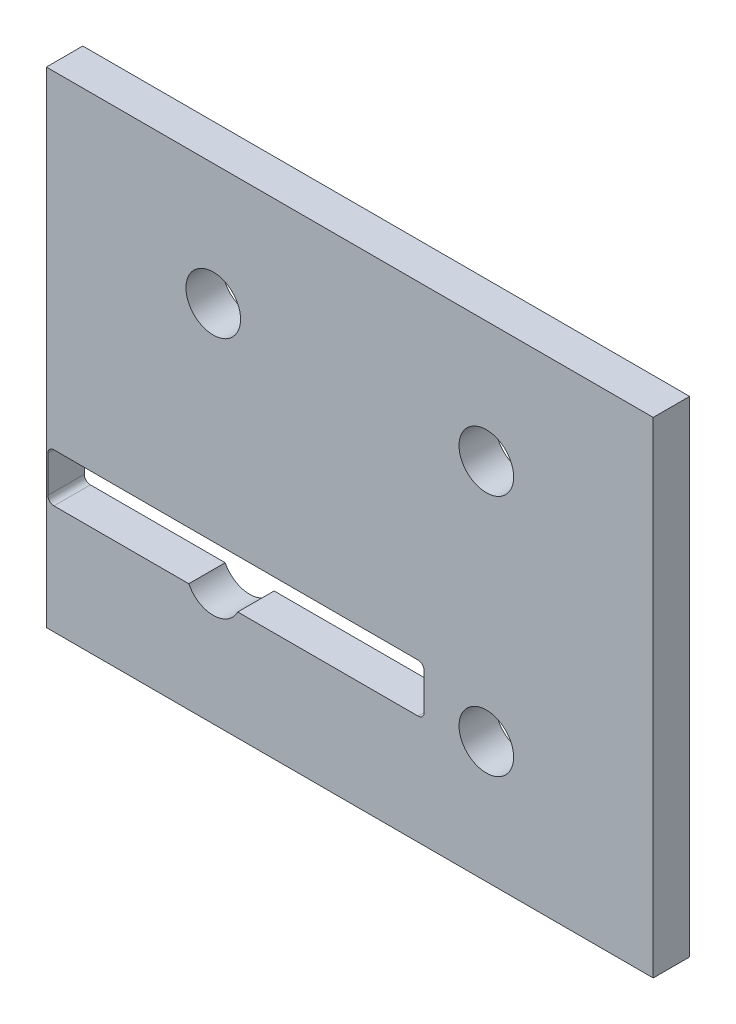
ISO-10303-21;
HEADER;
FILE_DESCRIPTION(('STEP AP214'),'2;1');
FILE_NAME('part.step','',(''),(''),'','','');
FILE_SCHEMA(('AUTOMOTIVE_DESIGN { 1 0 10303 214 1 1 1 1 }'));
ENDSEC;
DATA;
#1=APPLICATION_CONTEXT('core data for automotive mechanical design processes');
#2=APPLICATION_PROTOCOL_DEFINITION('international standard','automotive_design',2000,#1);
#3=PRODUCT_CONTEXT('',#1,'mechanical');
#4=PRODUCT('Part','Part','',(#3));
#5=PRODUCT_RELATED_PRODUCT_CATEGORY('part','',(#4));
#6=PRODUCT_DEFINITION_FORMATION('','',#4);
#7=PRODUCT_DEFINITION_CONTEXT('part definition',#1,'design');
#8=PRODUCT_DEFINITION('design','',#6,#7);
#9=PRODUCT_DEFINITION_SHAPE('','',#8);
#10=(LENGTH_UNIT() NAMED_UNIT(*) SI_UNIT(.MILLI.,.METRE.));
#11=(NAMED_UNIT(*) PLANE_ANGLE_UNIT() SI_UNIT($,.RADIAN.));
#12=(NAMED_UNIT(*) SI_UNIT($,.STERADIAN.) SOLID_ANGLE_UNIT());
#13=UNCERTAINTY_MEASURE_WITH_UNIT(LENGTH_MEASURE(1.E-05),#10,'distance_accuracy_value','');
#14=(GEOMETRIC_REPRESENTATION_CONTEXT(3) GLOBAL_UNCERTAINTY_ASSIGNED_CONTEXT((#13)) GLOBAL_UNIT_ASSIGNED_CONTEXT((#10,
#11,#12)) REPRESENTATION_CONTEXT('',''));
#15=CARTESIAN_POINT('',(0.,0.,0.));
#16=DIRECTION('',(0.,0.,1.));
#17=DIRECTION('',(1.,0.,0.));
#18=AXIS2_PLACEMENT_3D('',#15,#16,#17);
#19=CARTESIAN_POINT('',(45.,40.,0.));
#20=DIRECTION('',(0.,0.,-1.));
#21=DIRECTION('',(1.,0.,0.));
#22=AXIS2_PLACEMENT_3D('',#19,#20,#21);
#23=CYLINDRICAL_SURFACE('',#22,9.);
#24=DIRECTION('',(0.,0.,1.));
#25=VECTOR('',#24,1.);
#26=CARTESIAN_POINT('',(54.,40.,0.));
#27=LINE('',#26,#25);
#28=CARTESIAN_POINT('',(54.,40.,0.));
#29=VERTEX_POINT('',#28);
#30=CARTESIAN_POINT('',(54.,40.,12.));
#31=VERTEX_POINT('',#30);
#32=EDGE_CURVE('E10',#29,#31,#27,.T.);
#33=ORIENTED_EDGE('',*,*,#32,.T.);
#34=CARTESIAN_POINT('',(45.,40.,12.));
#35=DIRECTION('',(0.,0.,1.));
#36=DIRECTION('',(1.,0.,0.));
#37=AXIS2_PLACEMENT_3D('',#34,#35,#36);
#38=CIRCLE('',#37,9.);
#39=EDGE_CURVE('E290',#31,#31,#38,.T.);
#40=ORIENTED_EDGE('',*,*,#39,.T.);
#41=ORIENTED_EDGE('',*,*,#32,.F.);
#42=CARTESIAN_POINT('',(45.,40.,0.));
#43=DIRECTION('',(0.,0.,1.));
#44=DIRECTION('',(1.,0.,0.));
#45=AXIS2_PLACEMENT_3D('',#42,#43,#44);
#46=CIRCLE('',#45,9.);
#47=EDGE_CURVE('E240',#29,#29,#46,.T.);
#48=ORIENTED_EDGE('',*,*,#47,.F.);
#49=EDGE_LOOP('',(#33,#40,#41,#48));
#50=FACE_BOUND('',#49,.T.);
#51=ADVANCED_FACE('F16',(#50),#23,.F.);
#52=CARTESIAN_POINT('',(-45.,40.,0.));
#53=DIRECTION('',(0.,0.,-1.));
#54=DIRECTION('',(1.,0.,0.));
#55=AXIS2_PLACEMENT_3D('',#52,#53,#54);
#56=CYLINDRICAL_SURFACE('',#55,9.);
#57=DIRECTION('',(0.,0.,1.));
#58=VECTOR('',#57,1.);
#59=CARTESIAN_POINT('',(-36.,40.,0.));
#60=LINE('',#59,#58);
#61=CARTESIAN_POINT('',(-36.,40.,0.));
#62=VERTEX_POINT('',#61);
#63=CARTESIAN_POINT('',(-36.,40.,12.));
#64=VERTEX_POINT('',#63);
#65=EDGE_CURVE('E19',#62,#64,#60,.T.);
#66=ORIENTED_EDGE('',*,*,#65,.T.);
#67=CARTESIAN_POINT('',(-45.,40.,12.));
#68=DIRECTION('',(0.,0.,1.));
#69=DIRECTION('',(1.,0.,0.));
#70=AXIS2_PLACEMENT_3D('',#67,#68,#69);
#71=CIRCLE('',#70,9.);
#72=EDGE_CURVE('E287',#64,#64,#71,.T.);
#73=ORIENTED_EDGE('',*,*,#72,.T.);
#74=ORIENTED_EDGE('',*,*,#65,.F.);
#75=CARTESIAN_POINT('',(-45.,40.,0.));
#76=DIRECTION('',(0.,0.,1.));
#77=DIRECTION('',(1.,0.,0.));
#78=AXIS2_PLACEMENT_3D('',#75,#76,#77);
#79=CIRCLE('',#78,9.);
#80=EDGE_CURVE('E236',#62,#62,#79,.T.);
#81=ORIENTED_EDGE('',*,*,#80,.F.);
#82=EDGE_LOOP('',(#66,#73,#74,#81));
#83=FACE_BOUND('',#82,.T.);
#84=ADVANCED_FACE('F462',(#83),#56,.F.);
#85=CARTESIAN_POINT('',(45.,-40.,0.));
#86=DIRECTION('',(0.,0.,-1.));
#87=DIRECTION('',(1.,0.,0.));
#88=AXIS2_PLACEMENT_3D('',#85,#86,#87);
#89=CYLINDRICAL_SURFACE('',#88,9.);
#90=DIRECTION('',(0.,0.,1.));
#91=VECTOR('',#90,1.);
#92=CARTESIAN_POINT('',(54.,-40.,0.));
#93=LINE('',#92,#91);
#94=CARTESIAN_POINT('',(54.,-40.,0.));
#95=VERTEX_POINT('',#94);
#96=CARTESIAN_POINT('',(54.,-40.,12.));
#97=VERTEX_POINT('',#96);
#98=EDGE_CURVE('E307',#95,#97,#93,.T.);
#99=ORIENTED_EDGE('',*,*,#98,.T.);
#100=CARTESIAN_POINT('',(45.,-40.,12.));
#101=DIRECTION('',(0.,0.,1.));
#102=DIRECTION('',(1.,0.,0.));
#103=AXIS2_PLACEMENT_3D('',#100,#101,#102);
#104=CIRCLE('',#103,9.);
#105=EDGE_CURVE('E215',#97,#97,#104,.T.);
#106=ORIENTED_EDGE('',*,*,#105,.T.);
#107=ORIENTED_EDGE('',*,*,#98,.F.);
#108=CARTESIAN_POINT('',(45.,-40.,0.));
#109=DIRECTION('',(0.,0.,1.));
#110=DIRECTION('',(1.,0.,0.));
#111=AXIS2_PLACEMENT_3D('',#108,#109,#110);
#112=CIRCLE('',#111,9.);
#113=EDGE_CURVE('E232',#95,#95,#112,.T.);
#114=ORIENTED_EDGE('',*,*,#113,.F.);
#115=EDGE_LOOP('',(#99,#106,#107,#114));
#116=FACE_BOUND('',#115,.T.);
#117=ADVANCED_FACE('F446',(#116),#89,.F.);
#118=CARTESIAN_POINT('',(-37.5,-44.,54.));
#119=DIRECTION('',(0.,1.,0.));
#120=DIRECTION('',(1.,0.,0.));
#121=AXIS2_PLACEMENT_3D('',#118,#119,#120);
#122=PLANE('',#121);
#123=DIRECTION('',(-1.,0.,0.));
#124=VECTOR('',#123,1.);
#125=CARTESIAN_POINT('',(-18.75,-44.,0.));
#126=LINE('',#125,#124);
#127=CARTESIAN_POINT('',(-53.06225774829,-44.,0.));
#128=VERTEX_POINT('',#127);
#129=CARTESIAN_POINT('',(-97.5,-44.,0.));
#130=VERTEX_POINT('',#129);
#131=EDGE_CURVE('E224',#128,#130,#126,.T.);
#132=ORIENTED_EDGE('',*,*,#131,.T.);
#133=DIRECTION('',(0.,0.,1.));
#134=VECTOR('',#133,1.);
#135=CARTESIAN_POINT('',(-97.5,-44.,-6.));
#136=LINE('',#135,#134);
#137=CARTESIAN_POINT('',(-97.5,-44.,12.));
#138=VERTEX_POINT('',#137);
#139=EDGE_CURVE('E248',#130,#138,#136,.T.);
#140=ORIENTED_EDGE('',*,*,#139,.T.);
#141=DIRECTION('',(-1.,0.,0.));
#142=VECTOR('',#141,1.);
#143=CARTESIAN_POINT('',(-18.75,-44.,12.));
#144=LINE('',#143,#142);
#145=CARTESIAN_POINT('',(-53.06225774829,-44.,12.));
#146=VERTEX_POINT('',#145);
#147=EDGE_CURVE('E256',#146,#138,#144,.T.);
#148=ORIENTED_EDGE('',*,*,#147,.F.);
#149=DIRECTION('',(0.,0.,-1.));
#150=VECTOR('',#149,1.);
#151=CARTESIAN_POINT('',(-53.06225774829,-44.,0.));
#152=LINE('',#151,#150);
#153=EDGE_CURVE('E293',#146,#128,#152,.T.);
#154=ORIENTED_EDGE('',*,*,#153,.T.);
#155=EDGE_LOOP('',(#132,#140,#148,#154));
#156=FACE_BOUND('',#155,.T.);
#157=ADVANCED_FACE('F441',(#156),#122,.T.);
#158=CARTESIAN_POINT('',(-97.5,-42.,-6.));
#159=DIRECTION('',(0.,0.,1.));
#160=DIRECTION('',(0.,1.,0.));
#161=AXIS2_PLACEMENT_3D('',#158,#159,#160);
#162=CYLINDRICAL_SURFACE('',#161,2.);
#163=CARTESIAN_POINT('',(-97.5,-42.,12.));
#164=DIRECTION('',(0.,0.,1.));
#165=DIRECTION('',(0.,1.,0.));
#166=AXIS2_PLACEMENT_3D('',#163,#164,#165);
#167=CIRCLE('',#166,2.);
#168=CARTESIAN_POINT('',(-99.5,-42.,12.));
#169=VERTEX_POINT('',#168);
#170=EDGE_CURVE('E257',#169,#138,#167,.T.);
#171=ORIENTED_EDGE('',*,*,#170,.T.);
#172=ORIENTED_EDGE('',*,*,#139,.F.);
#173=CARTESIAN_POINT('',(-97.5,-42.,0.));
#174=DIRECTION('',(0.,0.,1.));
#175=DIRECTION('',(0.,1.,0.));
#176=AXIS2_PLACEMENT_3D('',#173,#174,#175);
#177=CIRCLE('',#176,2.);
#178=CARTESIAN_POINT('',(-99.5,-42.,0.));
#179=VERTEX_POINT('',#178);
#180=EDGE_CURVE('E220',#179,#130,#177,.T.);
#181=ORIENTED_EDGE('',*,*,#180,.F.);
#182=DIRECTION('',(0.,0.,1.));
#183=VECTOR('',#182,1.);
#184=CARTESIAN_POINT('',(-99.5,-42.,-6.));
#185=LINE('',#184,#183);
#186=EDGE_CURVE('E245',#179,#169,#185,.T.);
#187=ORIENTED_EDGE('',*,*,#186,.T.);
#188=EDGE_LOOP('',(#171,#172,#181,#187));
#189=FACE_BOUND('',#188,.T.);
#190=ADVANCED_FACE('F435',(#189),#162,.F.);
#191=CARTESIAN_POINT('',(-99.5,-42.,-6.));
#192=DIRECTION('',(1.,0.,0.));
#193=DIRECTION('',(0.,1.,0.));
#194=AXIS2_PLACEMENT_3D('',#191,#192,#193);
#195=PLANE('',#194);
#196=ORIENTED_EDGE('',*,*,#186,.F.);
#197=DIRECTION('',(0.,1.,0.));
#198=VECTOR('',#197,1.);
#199=CARTESIAN_POINT('',(-99.5,-21.,0.));
#200=LINE('',#199,#198);
#201=CARTESIAN_POINT('',(-99.5,-30.,0.));
#202=VERTEX_POINT('',#201);
#203=EDGE_CURVE('E219',#179,#202,#200,.T.);
#204=ORIENTED_EDGE('',*,*,#203,.T.);
#205=DIRECTION('',(0.,0.,1.));
#206=VECTOR('',#205,1.);
#207=CARTESIAN_POINT('',(-99.5,-30.,-6.));
#208=LINE('',#207,#206);
#209=CARTESIAN_POINT('',(-99.5,-30.,12.));
#210=VERTEX_POINT('',#209);
#211=EDGE_CURVE('E249',#202,#210,#208,.T.);
#212=ORIENTED_EDGE('',*,*,#211,.T.);
#213=DIRECTION('',(0.,1.,0.));
#214=VECTOR('',#213,1.);
#215=CARTESIAN_POINT('',(-99.5,-21.,12.));
#216=LINE('',#215,#214);
#217=EDGE_CURVE('E261',#169,#210,#216,.T.);
#218=ORIENTED_EDGE('',*,*,#217,.F.);
#219=EDGE_LOOP('',(#196,#204,#212,#218));
#220=FACE_BOUND('',#219,.T.);
#221=ADVANCED_FACE('F381',(#220),#195,.T.);
#222=CARTESIAN_POINT('',(-97.5,-30.,-6.));
#223=DIRECTION('',(0.,0.,1.));
#224=DIRECTION('',(0.,-1.,0.));
#225=AXIS2_PLACEMENT_3D('',#222,#223,#224);
#226=CYLINDRICAL_SURFACE('',#225,2.);
#227=ORIENTED_EDGE('',*,*,#211,.F.);
#228=CARTESIAN_POINT('',(-97.5,-30.,0.));
#229=DIRECTION('',(0.,0.,1.));
#230=DIRECTION('',(0.,-1.,0.));
#231=AXIS2_PLACEMENT_3D('',#228,#229,#230);
#232=CIRCLE('',#231,2.);
#233=CARTESIAN_POINT('',(-97.5,-28.,0.));
#234=VERTEX_POINT('',#233);
#235=EDGE_CURVE('E195',#234,#202,#232,.T.);
#236=ORIENTED_EDGE('',*,*,#235,.F.);
#237=DIRECTION('',(0.,0.,1.));
#238=VECTOR('',#237,1.);
#239=CARTESIAN_POINT('',(-97.5,-28.,-6.));
#240=LINE('',#239,#238);
#241=CARTESIAN_POINT('',(-97.5,-28.,12.));
#242=VERTEX_POINT('',#241);
#243=EDGE_CURVE('E185',#234,#242,#240,.T.);
#244=ORIENTED_EDGE('',*,*,#243,.T.);
#245=CARTESIAN_POINT('',(-97.5,-30.,12.));
#246=DIRECTION('',(0.,0.,1.));
#247=DIRECTION('',(0.,-1.,0.));
#248=AXIS2_PLACEMENT_3D('',#245,#246,#247);
#249=CIRCLE('',#248,2.);
#250=EDGE_CURVE('E265',#242,#210,#249,.T.);
#251=ORIENTED_EDGE('',*,*,#250,.T.);
#252=EDGE_LOOP('',(#227,#236,#244,#251));
#253=FACE_BOUND('',#252,.T.);
#254=ADVANCED_FACE('F333',(#253),#226,.F.);
#255=CARTESIAN_POINT('',(-37.5,-28.,54.));
#256=DIRECTION('',(0.,1.,0.));
#257=DIRECTION('',(1.,0.,0.));
#258=AXIS2_PLACEMENT_3D('',#255,#256,#257);
#259=PLANE('',#258);
#260=DIRECTION('',(0.,0.,-1.));
#261=VECTOR('',#260,1.);
#262=CARTESIAN_POINT('',(22.5,-28.,114.));
#263=LINE('',#262,#261);
#264=CARTESIAN_POINT('',(22.5,-28.,12.));
#265=VERTEX_POINT('',#264);
#266=CARTESIAN_POINT('',(22.5,-28.,0.));
#267=VERTEX_POINT('',#266);
#268=EDGE_CURVE('E173',#265,#267,#263,.T.);
#269=ORIENTED_EDGE('',*,*,#268,.F.);
#270=DIRECTION('',(-1.,0.,0.));
#271=VECTOR('',#270,1.);
#272=CARTESIAN_POINT('',(-18.75,-28.,12.));
#273=LINE('',#272,#271);
#274=EDGE_CURVE('E269',#265,#242,#273,.T.);
#275=ORIENTED_EDGE('',*,*,#274,.T.);
#276=ORIENTED_EDGE('',*,*,#243,.F.);
#277=DIRECTION('',(-1.,0.,0.));
#278=VECTOR('',#277,1.);
#279=CARTESIAN_POINT('',(-18.75,-28.,0.));
#280=LINE('',#279,#278);
#281=EDGE_CURVE('E189',#267,#234,#280,.T.);
#282=ORIENTED_EDGE('',*,*,#281,.F.);
#283=EDGE_LOOP('',(#269,#275,#276,#282));
#284=FACE_BOUND('',#283,.T.);
#285=ADVANCED_FACE('F190',(#284),#259,.F.);
#286=CARTESIAN_POINT('',(22.5,-30.,114.));
#287=DIRECTION('',(0.,0.,-1.));
#288=DIRECTION('',(0.,-1.,0.));
#289=AXIS2_PLACEMENT_3D('',#286,#287,#288);
#290=CYLINDRICAL_SURFACE('',#289,2.);
#291=DIRECTION('',(0.,0.,-1.));
#292=VECTOR('',#291,1.);
#293=CARTESIAN_POINT('',(24.5,-30.,114.));
#294=LINE('',#293,#292);
#295=CARTESIAN_POINT('',(24.5,-30.,12.));
#296=VERTEX_POINT('',#295);
#297=CARTESIAN_POINT('',(24.5,-30.,0.));
#298=VERTEX_POINT('',#297);
#299=EDGE_CURVE('E186',#296,#298,#294,.T.);
#300=ORIENTED_EDGE('',*,*,#299,.F.);
#301=CARTESIAN_POINT('',(22.5,-30.,12.));
#302=DIRECTION('',(0.,0.,-1.));
#303=DIRECTION('',(0.,-1.,0.));
#304=AXIS2_PLACEMENT_3D('',#301,#302,#303);
#305=CIRCLE('',#304,2.);
#306=EDGE_CURVE('E180',#265,#296,#305,.T.);
#307=ORIENTED_EDGE('',*,*,#306,.F.);
#308=ORIENTED_EDGE('',*,*,#268,.T.);
#309=CARTESIAN_POINT('',(22.5,-30.,0.));
#310=DIRECTION('',(0.,0.,-1.));
#311=DIRECTION('',(0.,-1.,0.));
#312=AXIS2_PLACEMENT_3D('',#309,#310,#311);
#313=CIRCLE('',#312,2.);
#314=EDGE_CURVE('E177',#267,#298,#313,.T.);
#315=ORIENTED_EDGE('',*,*,#314,.T.);
#316=EDGE_LOOP('',(#300,#307,#308,#315));
#317=FACE_BOUND('',#316,.T.);
#318=ADVANCED_FACE('F175',(#317),#290,.F.);
#319=CARTESIAN_POINT('',(24.5,-42.,114.));
#320=DIRECTION('',(-1.,0.,0.));
#321=DIRECTION('',(0.,0.,1.));
#322=AXIS2_PLACEMENT_3D('',#319,#320,#321);
#323=PLANE('',#322);
#324=DIRECTION('',(0.,0.,-1.));
#325=VECTOR('',#324,1.);
#326=CARTESIAN_POINT('',(24.5,-42.,114.));
#327=LINE('',#326,#325);
#328=CARTESIAN_POINT('',(24.5,-42.,12.));
#329=VERTEX_POINT('',#328);
#330=CARTESIAN_POINT('',(24.5,-42.,0.));
#331=VERTEX_POINT('',#330);
#332=EDGE_CURVE('E274',#329,#331,#327,.T.);
#333=ORIENTED_EDGE('',*,*,#332,.F.);
#334=DIRECTION('',(0.,-1.,0.));
#335=VECTOR('',#334,1.);
#336=CARTESIAN_POINT('',(24.5,-21.,12.));
#337=LINE('',#336,#335);
#338=EDGE_CURVE('E277',#296,#329,#337,.T.);
#339=ORIENTED_EDGE('',*,*,#338,.F.);
#340=ORIENTED_EDGE('',*,*,#299,.T.);
#341=DIRECTION('',(0.,-1.,0.));
#342=VECTOR('',#341,1.);
#343=CARTESIAN_POINT('',(24.5,-21.,0.));
#344=LINE('',#343,#342);
#345=EDGE_CURVE('E202',#298,#331,#344,.T.);
#346=ORIENTED_EDGE('',*,*,#345,.T.);
#347=EDGE_LOOP('',(#333,#339,#340,#346));
#348=FACE_BOUND('',#347,.T.);
#349=ADVANCED_FACE('F339',(#348),#323,.T.);
#350=CARTESIAN_POINT('',(22.5,-42.,114.));
#351=DIRECTION('',(0.,0.,-1.));
#352=DIRECTION('',(0.,1.,0.));
#353=AXIS2_PLACEMENT_3D('',#350,#351,#352);
#354=CYLINDRICAL_SURFACE('',#353,2.);
#355=CARTESIAN_POINT('',(22.5,-42.,0.));
#356=DIRECTION('',(0.,0.,-1.));
#357=DIRECTION('',(0.,1.,0.));
#358=AXIS2_PLACEMENT_3D('',#355,#356,#357);
#359=CIRCLE('',#358,2.);
#360=CARTESIAN_POINT('',(22.5,-44.,0.));
#361=VERTEX_POINT('',#360);
#362=EDGE_CURVE('E208',#331,#361,#359,.T.);
#363=ORIENTED_EDGE('',*,*,#362,.T.);
#364=DIRECTION('',(0.,0.,-1.));
#365=VECTOR('',#364,1.);
#366=CARTESIAN_POINT('',(22.5,-44.,114.));
#367=LINE('',#366,#365);
#368=CARTESIAN_POINT('',(22.5,-44.,12.));
#369=VERTEX_POINT('',#368);
#370=EDGE_CURVE('E297',#369,#361,#367,.T.);
#371=ORIENTED_EDGE('',*,*,#370,.F.);
#372=CARTESIAN_POINT('',(22.5,-42.,12.));
#373=DIRECTION('',(0.,0.,-1.));
#374=DIRECTION('',(0.,1.,0.));
#375=AXIS2_PLACEMENT_3D('',#372,#373,#374);
#376=CIRCLE('',#375,2.);
#377=EDGE_CURVE('E216',#329,#369,#376,.T.);
#378=ORIENTED_EDGE('',*,*,#377,.F.);
#379=ORIENTED_EDGE('',*,*,#332,.T.);
#380=EDGE_LOOP('',(#363,#371,#378,#379));
#381=FACE_BOUND('',#380,.T.);
#382=ADVANCED_FACE('F344',(#381),#354,.F.);
#383=CARTESIAN_POINT('',(-37.5,-44.,54.));
#384=DIRECTION('',(0.,1.,0.));
#385=DIRECTION('',(1.,0.,0.));
#386=AXIS2_PLACEMENT_3D('',#383,#384,#385);
#387=PLANE('',#386);
#388=ORIENTED_EDGE('',*,*,#370,.T.);
#389=DIRECTION('',(-1.,0.,0.));
#390=VECTOR('',#389,1.);
#391=CARTESIAN_POINT('',(-18.75,-44.,0.));
#392=LINE('',#391,#390);
#393=CARTESIAN_POINT('',(-36.9377422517,-44.,0.));
#394=VERTEX_POINT('',#393);
#395=EDGE_CURVE('E528',#361,#394,#392,.T.);
#396=ORIENTED_EDGE('',*,*,#395,.T.);
#397=DIRECTION('',(0.,0.,-1.));
#398=VECTOR('',#397,1.);
#399=CARTESIAN_POINT('',(-36.9377422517,-44.,0.));
#400=LINE('',#399,#398);
#401=CARTESIAN_POINT('',(-36.9377422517,-44.,12.));
#402=VERTEX_POINT('',#401);
#403=EDGE_CURVE('E294',#402,#394,#400,.T.);
#404=ORIENTED_EDGE('',*,*,#403,.F.);
#405=DIRECTION('',(-1.,0.,0.));
#406=VECTOR('',#405,1.);
#407=CARTESIAN_POINT('',(-18.75,-44.,12.));
#408=LINE('',#407,#406);
#409=EDGE_CURVE('E212',#369,#402,#408,.T.);
#410=ORIENTED_EDGE('',*,*,#409,.F.);
#411=EDGE_LOOP('',(#388,#396,#404,#410));
#412=FACE_BOUND('',#411,.T.);
#413=ADVANCED_FACE('F360',(#412),#387,.T.);
#414=CARTESIAN_POINT('',(-45.,-40.,0.));
#415=DIRECTION('',(0.,0.,-1.));
#416=DIRECTION('',(1.,0.,0.));
#417=AXIS2_PLACEMENT_3D('',#414,#415,#416);
#418=CYLINDRICAL_SURFACE('',#417,9.);
#419=CARTESIAN_POINT('',(-45.,-40.,0.));
#420=DIRECTION('',(0.,0.,1.));
#421=DIRECTION('',(1.,0.,0.));
#422=AXIS2_PLACEMENT_3D('',#419,#420,#421);
#423=CIRCLE('',#422,9.);
#424=EDGE_CURVE('E228',#128,#394,#423,.T.);
#425=ORIENTED_EDGE('',*,*,#424,.F.);
#426=ORIENTED_EDGE('',*,*,#153,.F.);
#427=CARTESIAN_POINT('',(-45.,-40.,12.));
#428=DIRECTION('',(0.,0.,1.));
#429=DIRECTION('',(1.,0.,0.));
#430=AXIS2_PLACEMENT_3D('',#427,#428,#429);
#431=CIRCLE('',#430,9.);
#432=EDGE_CURVE('E252',#146,#402,#431,.T.);
#433=ORIENTED_EDGE('',*,*,#432,.T.);
#434=ORIENTED_EDGE('',*,*,#403,.T.);
#435=EDGE_LOOP('',(#425,#426,#433,#434));
#436=FACE_BOUND('',#435,.T.);
#437=ADVANCED_FACE('F365',(#436),#418,.F.);
#438=CARTESIAN_POINT('',(100.,80.,0.));
#439=DIRECTION('',(0.,-1.,0.));
#440=DIRECTION('',(0.,0.,-1.));
#441=AXIS2_PLACEMENT_3D('',#438,#439,#440);
#442=PLANE('',#441);
#443=DIRECTION('',(-1.,0.,0.));
#444=VECTOR('',#443,1.);
#445=CARTESIAN_POINT('',(100.,80.,0.));
#446=LINE('',#445,#444);
#447=CARTESIAN_POINT('',(100.,80.,0.));
#448=VERTEX_POINT('',#447);
#449=CARTESIAN_POINT('',(-100.,80.,0.));
#450=VERTEX_POINT('',#449);
#451=EDGE_CURVE('E519',#448,#450,#446,.T.);
#452=ORIENTED_EDGE('',*,*,#451,.T.);
#453=DIRECTION('',(0.,0.,1.));
#454=VECTOR('',#453,1.);
#455=CARTESIAN_POINT('',(-100.,80.,0.));
#456=LINE('',#455,#454);
#457=CARTESIAN_POINT('',(-100.,80.,12.));
#458=VERTEX_POINT('',#457);
#459=EDGE_CURVE('E524',#450,#458,#456,.T.);
#460=ORIENTED_EDGE('',*,*,#459,.T.);
#461=DIRECTION('',(-1.,0.,0.));
#462=VECTOR('',#461,1.);
#463=CARTESIAN_POINT('',(100.,80.,12.));
#464=LINE('',#463,#462);
#465=CARTESIAN_POINT('',(100.,80.,12.));
#466=VERTEX_POINT('',#465);
#467=EDGE_CURVE('E244',#466,#458,#464,.T.);
#468=ORIENTED_EDGE('',*,*,#467,.F.);
#469=DIRECTION('',(0.,0.,1.));
#470=VECTOR('',#469,1.);
#471=CARTESIAN_POINT('',(100.,80.,0.));
#472=LINE('',#471,#470);
#473=EDGE_CURVE('E520',#448,#466,#472,.T.);
#474=ORIENTED_EDGE('',*,*,#473,.F.);
#475=EDGE_LOOP('',(#452,#460,#468,#474));
#476=FACE_BOUND('',#475,.T.);
#477=ADVANCED_FACE('F390',(#476),#442,.F.);
#478=CARTESIAN_POINT('',(0.,0.,12.));
#479=DIRECTION('',(0.,0.,1.));
#480=DIRECTION('',(1.,0.,0.));
#481=AXIS2_PLACEMENT_3D('',#478,#479,#480);
#482=PLANE('',#481);
#483=ORIENTED_EDGE('',*,*,#39,.F.);
#484=EDGE_LOOP('',(#483));
#485=FACE_BOUND('',#484,.T.);
#486=ORIENTED_EDGE('',*,*,#72,.F.);
#487=EDGE_LOOP('',(#486));
#488=FACE_BOUND('',#487,.T.);
#489=ORIENTED_EDGE('',*,*,#105,.F.);
#490=EDGE_LOOP('',(#489));
#491=FACE_BOUND('',#490,.T.);
#492=ORIENTED_EDGE('',*,*,#432,.F.);
#493=ORIENTED_EDGE('',*,*,#147,.T.);
#494=ORIENTED_EDGE('',*,*,#170,.F.);
#495=ORIENTED_EDGE('',*,*,#217,.T.);
#496=ORIENTED_EDGE('',*,*,#250,.F.);
#497=ORIENTED_EDGE('',*,*,#274,.F.);
#498=ORIENTED_EDGE('',*,*,#306,.T.);
#499=ORIENTED_EDGE('',*,*,#338,.T.);
#500=ORIENTED_EDGE('',*,*,#377,.T.);
#501=ORIENTED_EDGE('',*,*,#409,.T.);
#502=EDGE_LOOP('',(#492,#493,#494,#495,#496,#497,#498,#499,#500,#501));
#503=FACE_BOUND('',#502,.T.);
#504=DIRECTION('',(1.,0.,0.));
#505=VECTOR('',#504,1.);
#506=CARTESIAN_POINT('',(-100.,-80.,12.));
#507=LINE('',#506,#505);
#508=CARTESIAN_POINT('',(-100.,-80.,12.));
#509=VERTEX_POINT('',#508);
#510=CARTESIAN_POINT('',(100.,-80.,12.));
#511=VERTEX_POINT('',#510);
#512=EDGE_CURVE('E563',#509,#511,#507,.T.);
#513=ORIENTED_EDGE('',*,*,#512,.T.);
#514=DIRECTION('',(0.,1.,0.));
#515=VECTOR('',#514,1.);
#516=CARTESIAN_POINT('',(100.,-80.,12.));
#517=LINE('',#516,#515);
#518=EDGE_CURVE('E516',#511,#466,#517,.T.);
#519=ORIENTED_EDGE('',*,*,#518,.T.);
#520=ORIENTED_EDGE('',*,*,#467,.T.);
#521=DIRECTION('',(0.,-1.,0.));
#522=VECTOR('',#521,1.);
#523=CARTESIAN_POINT('',(-100.,80.,12.));
#524=LINE('',#523,#522);
#525=EDGE_CURVE('E558',#458,#509,#524,.T.);
#526=ORIENTED_EDGE('',*,*,#525,.T.);
#527=EDGE_LOOP('',(#513,#519,#520,#526));
#528=FACE_BOUND('',#527,.T.);
#529=ADVANCED_FACE('F399',(#485,#488,#491,#503,#528),#482,.T.);
#530=CARTESIAN_POINT('',(0.,0.,0.));
#531=DIRECTION('',(0.,0.,1.));
#532=DIRECTION('',(1.,0.,0.));
#533=AXIS2_PLACEMENT_3D('',#530,#531,#532);
#534=PLANE('',#533);
#535=ORIENTED_EDGE('',*,*,#47,.T.);
#536=EDGE_LOOP('',(#535));
#537=FACE_BOUND('',#536,.T.);
#538=ORIENTED_EDGE('',*,*,#80,.T.);
#539=EDGE_LOOP('',(#538));
#540=FACE_BOUND('',#539,.T.);
#541=ORIENTED_EDGE('',*,*,#113,.T.);
#542=EDGE_LOOP('',(#541));
#543=FACE_BOUND('',#542,.T.);
#544=ORIENTED_EDGE('',*,*,#395,.F.);
#545=ORIENTED_EDGE('',*,*,#362,.F.);
#546=ORIENTED_EDGE('',*,*,#345,.F.);
#547=ORIENTED_EDGE('',*,*,#314,.F.);
#548=ORIENTED_EDGE('',*,*,#281,.T.);
#549=ORIENTED_EDGE('',*,*,#235,.T.);
#550=ORIENTED_EDGE('',*,*,#203,.F.);
#551=ORIENTED_EDGE('',*,*,#180,.T.);
#552=ORIENTED_EDGE('',*,*,#131,.F.);
#553=ORIENTED_EDGE('',*,*,#424,.T.);
#554=EDGE_LOOP('',(#544,#545,#546,#547,#548,#549,#550,#551,#552,#553));
#555=FACE_BOUND('',#554,.T.);
#556=DIRECTION('',(0.,-1.,0.));
#557=VECTOR('',#556,1.);
#558=CARTESIAN_POINT('',(-100.,80.,0.));
#559=LINE('',#558,#557);
#560=CARTESIAN_POINT('',(-100.,-80.,0.));
#561=VERTEX_POINT('',#560);
#562=EDGE_CURVE('E555',#450,#561,#559,.T.);
#563=ORIENTED_EDGE('',*,*,#562,.F.);
#564=ORIENTED_EDGE('',*,*,#451,.F.);
#565=DIRECTION('',(0.,1.,0.));
#566=VECTOR('',#565,1.);
#567=CARTESIAN_POINT('',(100.,-80.,0.));
#568=LINE('',#567,#566);
#569=CARTESIAN_POINT('',(100.,-80.,0.));
#570=VERTEX_POINT('',#569);
#571=EDGE_CURVE('E521',#570,#448,#568,.T.);
#572=ORIENTED_EDGE('',*,*,#571,.F.);
#573=DIRECTION('',(1.,0.,0.));
#574=VECTOR('',#573,1.);
#575=CARTESIAN_POINT('',(-100.,-80.,0.));
#576=LINE('',#575,#574);
#577=EDGE_CURVE('E551',#561,#570,#576,.T.);
#578=ORIENTED_EDGE('',*,*,#577,.F.);
#579=EDGE_LOOP('',(#563,#564,#572,#578));
#580=FACE_BOUND('',#579,.T.);
#581=ADVANCED_FACE('F198',(#537,#540,#543,#555,#580),#534,.F.);
#582=CARTESIAN_POINT('',(100.,-80.,0.));
#583=DIRECTION('',(-1.,0.,0.));
#584=DIRECTION('',(0.,0.,1.));
#585=AXIS2_PLACEMENT_3D('',#582,#583,#584);
#586=PLANE('',#585);
#587=ORIENTED_EDGE('',*,*,#571,.T.);
#588=ORIENTED_EDGE('',*,*,#473,.T.);
#589=ORIENTED_EDGE('',*,*,#518,.F.);
#590=DIRECTION('',(0.,0.,1.));
#591=VECTOR('',#590,1.);
#592=CARTESIAN_POINT('',(100.,-80.,0.));
#593=LINE('',#592,#591);
#594=EDGE_CURVE('E554',#570,#511,#593,.T.);
#595=ORIENTED_EDGE('',*,*,#594,.F.);
#596=EDGE_LOOP('',(#587,#588,#589,#595));
#597=FACE_BOUND('',#596,.T.);
#598=ADVANCED_FACE('F350',(#597),#586,.F.);
#599=CARTESIAN_POINT('',(-100.,80.,0.));
#600=DIRECTION('',(1.,0.,0.));
#601=DIRECTION('',(0.,1.,0.));
#602=AXIS2_PLACEMENT_3D('',#599,#600,#601);
#603=PLANE('',#602);
#604=ORIENTED_EDGE('',*,*,#562,.T.);
#605=DIRECTION('',(0.,0.,1.));
#606=VECTOR('',#605,1.);
#607=CARTESIAN_POINT('',(-100.,-80.,0.));
#608=LINE('',#607,#606);
#609=EDGE_CURVE('E559',#561,#509,#608,.T.);
#610=ORIENTED_EDGE('',*,*,#609,.T.);
#611=ORIENTED_EDGE('',*,*,#525,.F.);
#612=ORIENTED_EDGE('',*,*,#459,.F.);
#613=EDGE_LOOP('',(#604,#610,#611,#612));
#614=FACE_BOUND('',#613,.T.);
#615=ADVANCED_FACE('F322',(#614),#603,.F.);
#616=CARTESIAN_POINT('',(-100.,-80.,0.));
#617=DIRECTION('',(0.,1.,0.));
#618=DIRECTION('',(1.,0.,0.));
#619=AXIS2_PLACEMENT_3D('',#616,#617,#618);
#620=PLANE('',#619);
#621=ORIENTED_EDGE('',*,*,#577,.T.);
#622=ORIENTED_EDGE('',*,*,#594,.T.);
#623=ORIENTED_EDGE('',*,*,#512,.F.);
#624=ORIENTED_EDGE('',*,*,#609,.F.);
#625=EDGE_LOOP('',(#621,#622,#623,#624));
#626=FACE_BOUND('',#625,.T.);
#627=ADVANCED_FACE('F317',(#626),#620,.F.);
#628=CLOSED_SHELL('',(#51,#84,#117,#157,#190,#221,#254,#285,#318,#349,#382,#413,#437,#477,#529,
#581,#598,#615,#627));
#629=MANIFOLD_SOLID_BREP('B1',#628);
#630=ADVANCED_BREP_SHAPE_REPRESENTATION('',(#18,#629),#14);
#631=SHAPE_DEFINITION_REPRESENTATION(#9,#630);
ENDSEC;
END-ISO-10303-21;
